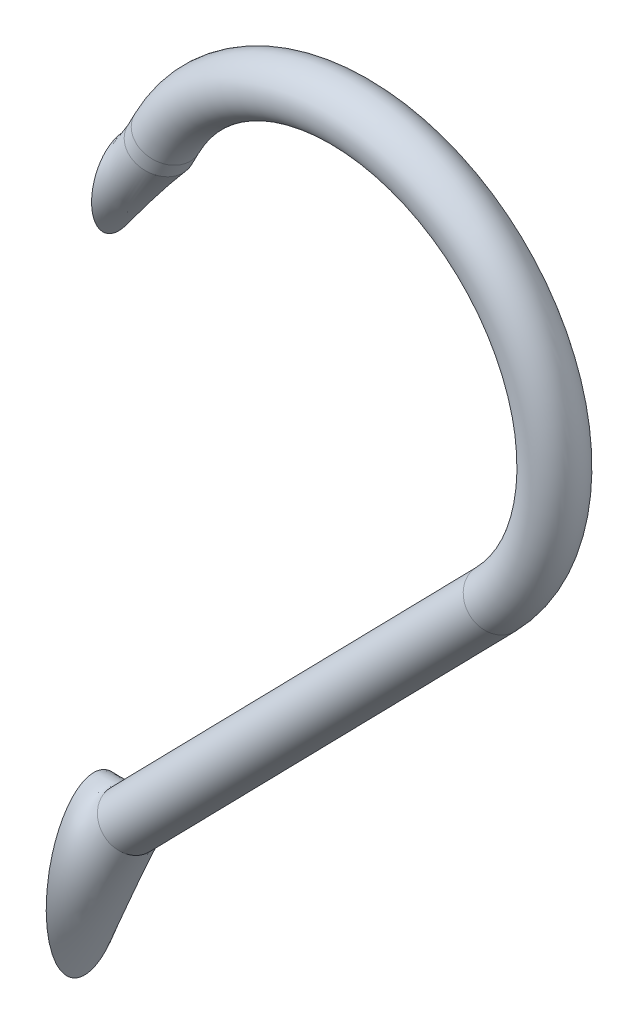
ISO-10303-21;
HEADER;
FILE_DESCRIPTION(('STEP AP214'),'2;1');
FILE_NAME('part.step','',(''),(''),'','','');
FILE_SCHEMA(('AUTOMOTIVE_DESIGN { 1 0 10303 214 1 1 1 1 }'));
ENDSEC;
DATA;
#1=APPLICATION_CONTEXT('core data for automotive mechanical design processes');
#2=APPLICATION_PROTOCOL_DEFINITION('international standard','automotive_design',2000,#1);
#3=PRODUCT_CONTEXT('',#1,'mechanical');
#4=PRODUCT('Part','Part','',(#3));
#5=PRODUCT_RELATED_PRODUCT_CATEGORY('part','',(#4));
#6=PRODUCT_DEFINITION_FORMATION('','',#4);
#7=PRODUCT_DEFINITION_CONTEXT('part definition',#1,'design');
#8=PRODUCT_DEFINITION('design','',#6,#7);
#9=PRODUCT_DEFINITION_SHAPE('','',#8);
#10=(LENGTH_UNIT() NAMED_UNIT(*) SI_UNIT(.MILLI.,.METRE.));
#11=(NAMED_UNIT(*) PLANE_ANGLE_UNIT() SI_UNIT($,.RADIAN.));
#12=(NAMED_UNIT(*) SI_UNIT($,.STERADIAN.) SOLID_ANGLE_UNIT());
#13=UNCERTAINTY_MEASURE_WITH_UNIT(LENGTH_MEASURE(1.E-05),#10,'distance_accuracy_value','');
#14=(GEOMETRIC_REPRESENTATION_CONTEXT(3) GLOBAL_UNCERTAINTY_ASSIGNED_CONTEXT((#13)) GLOBAL_UNIT_ASSIGNED_CONTEXT((#10,
#11,#12)) REPRESENTATION_CONTEXT('',''));
#15=CARTESIAN_POINT('',(0.,0.,0.));
#16=DIRECTION('',(0.,0.,1.));
#17=DIRECTION('',(1.,0.,0.));
#18=AXIS2_PLACEMENT_3D('',#15,#16,#17);
#19=CARTESIAN_POINT('',(31.3767815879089,43.2630513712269,0.));
#20=DIRECTION('',(0.462122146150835,0.886816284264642,0.));
#21=DIRECTION('',(-0.886816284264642,0.462122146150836,0.));
#22=AXIS2_PLACEMENT_3D('',#19,#20,#21);
#23=CYLINDRICAL_SURFACE('',#22,1.5);
#24=CARTESIAN_POINT('',(31.775093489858,44.0274152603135,0.));
#25=DIRECTION('',(-0.462122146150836,-0.886816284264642,0.));
#26=DIRECTION('',(0.886816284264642,-0.462122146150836,0.));
#27=AXIS2_PLACEMENT_3D('',#24,#25,#26);
#28=CIRCLE('',#27,1.5);
#29=CARTESIAN_POINT('',(30.4448690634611,44.7205984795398,0.));
#30=VERTEX_POINT('',#29);
#31=EDGE_CURVE('E65',#30,#30,#28,.T.);
#32=ORIENTED_EDGE('',*,*,#31,.T.);
#33=EDGE_LOOP('',(#32));
#34=FACE_BOUND('',#33,.T.);
#35=CARTESIAN_POINT('',(31.3767815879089,43.2630513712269,0.));
#36=DIRECTION('',(-0.462122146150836,-0.886816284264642,0.));
#37=DIRECTION('',(0.886816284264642,-0.462122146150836,0.));
#38=AXIS2_PLACEMENT_3D('',#35,#36,#37);
#39=CIRCLE('',#38,1.5);
#40=CARTESIAN_POINT('',(32.7070060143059,42.5698681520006,0.));
#41=VERTEX_POINT('',#40);
#42=EDGE_CURVE('E61',#41,#41,#39,.T.);
#43=ORIENTED_EDGE('',*,*,#42,.F.);
#44=EDGE_LOOP('',(#43));
#45=FACE_BOUND('',#44,.T.);
#46=ADVANCED_FACE('F57',(#34,#45),#23,.T.);
#47=CARTESIAN_POINT('',(42.0901426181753,38.6522177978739,0.));
#48=DIRECTION('',(0.,0.,-1.));
#49=DIRECTION('',(-1.,0.,0.));
#50=AXIS2_PLACEMENT_3D('',#47,#48,#49);
#51=TOROIDAL_SURFACE('',#50,11.6315513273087,1.5);
#52=CARTESIAN_POINT('',(50.4035236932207,30.5170668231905,0.));
#53=DIRECTION('',(0.69940378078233,0.714726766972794,0.));
#54=DIRECTION('',(-0.714726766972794,0.69940378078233,0.));
#55=AXIS2_PLACEMENT_3D('',#52,#53,#54);
#56=CIRCLE('',#55,1.5);
#57=CARTESIAN_POINT('',(51.4756138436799,29.467961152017,0.));
#58=VERTEX_POINT('',#57);
#59=EDGE_CURVE('E11',#58,#58,#56,.T.);
#60=CARTESIAN_POINT('',(42.0901426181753,38.6522177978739,0.));
#61=DIRECTION('',(0.,0.,-1.));
#62=DIRECTION('',(-1.,0.,0.));
#63=AXIS2_PLACEMENT_3D('',#60,#61,#62);
#64=CIRCLE('',#63,13.1315513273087);
#65=EDGE_CURVE('',#30,#58,#64,.T.);
#66=ORIENTED_EDGE('',*,*,#31,.F.);
#67=ORIENTED_EDGE('',*,*,#59,.T.);
#68=ORIENTED_EDGE('',*,*,#65,.T.);
#69=ORIENTED_EDGE('',*,*,#65,.F.);
#70=EDGE_LOOP('',(#66,#68,#67,#69));
#71=FACE_BOUND('',#70,.T.);
#72=ADVANCED_FACE('F146',(#71),#51,.T.);
#73=CARTESIAN_POINT('',(50.4035236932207,30.5170668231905,0.));
#74=DIRECTION('',(-0.699403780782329,-0.714726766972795,0.));
#75=DIRECTION('',(0.714726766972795,-0.699403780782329,0.));
#76=AXIS2_PLACEMENT_3D('',#73,#74,#75);
#77=CYLINDRICAL_SURFACE('',#76,1.5);
#78=CARTESIAN_POINT('',(29.7023887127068,9.36239811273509,0.));
#79=DIRECTION('',(0.69940378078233,0.714726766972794,0.));
#80=DIRECTION('',(-0.714726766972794,0.69940378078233,0.));
#81=AXIS2_PLACEMENT_3D('',#78,#79,#80);
#82=CIRCLE('',#81,1.5);
#83=CARTESIAN_POINT('',(28.6302985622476,10.4115037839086,0.));
#84=VERTEX_POINT('',#83);
#85=EDGE_CURVE('E71',#84,#84,#82,.T.);
#86=ORIENTED_EDGE('',*,*,#85,.T.);
#87=EDGE_LOOP('',(#86));
#88=FACE_BOUND('',#87,.T.);
#89=ORIENTED_EDGE('',*,*,#59,.F.);
#90=EDGE_LOOP('',(#89));
#91=FACE_BOUND('',#90,.T.);
#92=ADVANCED_FACE('F59',(#88,#91),#77,.T.);
#93=CARTESIAN_POINT('',(27.3910119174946,5.55956373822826,0.));
#94=DIRECTION('',(0.998664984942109,-0.0516550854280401,0.));
#95=DIRECTION('',(0.0516550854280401,0.998664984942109,0.));
#96=AXIS2_PLACEMENT_3D('',#93,#94,#95);
#97=PLANE('',#96);
#98=CARTESIAN_POINT('',(27.3910119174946,5.55956373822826,0.));
#99=DIRECTION('',(0.998664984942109,-0.0516550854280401,0.));
#100=DIRECTION('',(0.0516550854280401,0.998664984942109,0.));
#101=AXIS2_PLACEMENT_3D('',#98,#99,#100);
#102=ELLIPSE('',#101,5.10485482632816,2.41823915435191);
#103=CARTESIAN_POINT('',(27.6547036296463,10.6576035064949,0.));
#104=VERTEX_POINT('',#103);
#105=EDGE_CURVE('E74',#104,#104,#102,.T.);
#106=ORIENTED_EDGE('',*,*,#105,.F.);
#107=EDGE_LOOP('',(#106));
#108=FACE_BOUND('',#107,.T.);
#109=ADVANCED_FACE('F86',(#108),#97,.F.);
#110=CARTESIAN_POINT('',(27.128354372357,0.481517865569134,0.213961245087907));
#111=CARTESIAN_POINT('',(30.5928623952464,8.49101524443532,0.835313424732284));
#112=CARTESIAN_POINT('',(27.0816924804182,-0.420612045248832,-4.60354898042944));
#113=CARTESIAN_POINT('',(31.7869041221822,7.32257250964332,-1.65647427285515));
#114=CARTESIAN_POINT('',(27.6070075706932,9.73547970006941,-5.03147147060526));
#115=CARTESIAN_POINT('',(30.0059567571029,9.06533824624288,-3.32710112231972));
#116=CARTESIAN_POINT('',(27.6536694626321,10.6376096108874,-0.213961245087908));
#117=CARTESIAN_POINT('',(28.8119150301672,10.2337809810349,-0.835313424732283));
#118=CARTESIAN_POINT('',(27.700331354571,11.5397395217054,4.60354898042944));
#119=CARTESIAN_POINT('',(27.6178733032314,11.4022237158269,1.65647427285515));
#120=CARTESIAN_POINT('',(27.1750162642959,1.38364777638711,5.03147147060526));
#121=CARTESIAN_POINT('',(29.3988206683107,9.65945797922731,3.32710112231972));
#122=CARTESIAN_POINT('',(27.128354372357,0.481517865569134,0.213961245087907));
#123=CARTESIAN_POINT('',(30.5928623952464,8.49101524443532,0.835313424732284));
#124=(BOUNDED_SURFACE() B_SPLINE_SURFACE(3,1,((#110,#111),(#112,#113),(#114,#115),(#116,#117),
(#118,#119),(#120,#121),(#122,#123)),.UNSPECIFIED.,.T.,.F.,.F.) B_SPLINE_SURFACE_WITH_KNOTS((4,
3,4),(2,2),(0.,0.5,1.),(0.,1.),
.UNSPECIFIED.) GEOMETRIC_REPRESENTATION_ITEM() RATIONAL_B_SPLINE_SURFACE(((1.,1.),
(0.333333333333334,0.333333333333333),(0.333333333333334,0.333333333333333),(1.,1.),
(0.333333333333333,0.333333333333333),(0.333333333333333,0.333333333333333),(1.,1.))) REPRESENTATION_ITEM('') SURFACE());
#125=ORIENTED_EDGE('',*,*,#105,.T.);
#126=EDGE_LOOP('',(#125));
#127=FACE_BOUND('',#126,.T.);
#128=ORIENTED_EDGE('',*,*,#85,.F.);
#129=EDGE_LOOP('',(#128));
#130=FACE_BOUND('',#129,.T.);
#131=ADVANCED_FACE('F96',(#127,#130),#124,.T.);
#132=CARTESIAN_POINT('',(29.1927330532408,40.3928390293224,0.));
#133=DIRECTION('',(0.998664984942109,-0.0516550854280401,0.));
#134=DIRECTION('',(0.0516550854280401,0.998664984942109,0.));
#135=AXIS2_PLACEMENT_3D('',#132,#133,#134);
#136=PLANE('',#135);
#137=CARTESIAN_POINT('',(29.1927330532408,40.3928390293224,0.));
#138=DIRECTION('',(0.998664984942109,-0.0516550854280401,0.));
#139=DIRECTION('',(0.0516550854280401,0.998664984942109,0.));
#140=AXIS2_PLACEMENT_3D('',#137,#138,#139);
#141=ELLIPSE('',#140,2.48810244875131,1.65965828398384);
#142=CARTESIAN_POINT('',(29.3212561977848,42.877619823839,0.));
#143=VERTEX_POINT('',#142);
#144=EDGE_CURVE('E79',#143,#143,#141,.T.);
#145=ORIENTED_EDGE('',*,*,#144,.F.);
#146=EDGE_LOOP('',(#145));
#147=FACE_BOUND('',#146,.T.);
#148=ADVANCED_FACE('F108',(#147),#136,.F.);
#149=CARTESIAN_POINT('',(29.3212561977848,42.877619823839,0.));
#150=CARTESIAN_POINT('',(30.2478368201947,43.851347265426,-0.793342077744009));
#151=CARTESIAN_POINT('',(29.3212561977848,42.877619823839,3.31931656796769));
#152=CARTESIAN_POINT('',(28.8407394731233,44.5845891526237,1.75272025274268));
#153=CARTESIAN_POINT('',(29.0642099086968,37.9080582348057,3.31931656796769));
#154=CARTESIAN_POINT('',(31.0986290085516,43.4079973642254,3.33940440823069));
#155=CARTESIAN_POINT('',(29.0642099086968,37.9080582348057,0.));
#156=CARTESIAN_POINT('',(32.5057263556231,42.6747554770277,0.793342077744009));
#157=CARTESIAN_POINT('',(29.0642099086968,37.9080582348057,-3.31931656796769));
#158=CARTESIAN_POINT('',(33.9128237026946,41.9415135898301,-1.75272025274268));
#159=CARTESIAN_POINT('',(29.3212561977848,42.877619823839,-3.31931656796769));
#160=CARTESIAN_POINT('',(31.6549341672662,43.1181053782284,-3.33940440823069));
#161=CARTESIAN_POINT('',(29.3212561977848,42.877619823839,0.));
#162=CARTESIAN_POINT('',(30.2478368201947,43.851347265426,-0.793342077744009));
#163=(BOUNDED_SURFACE() B_SPLINE_SURFACE(3,1,((#149,#150),(#151,#152),(#153,#154),(#155,#156),
(#157,#158),(#159,#160),(#161,#162)),.UNSPECIFIED.,.T.,.F.,.F.) B_SPLINE_SURFACE_WITH_KNOTS((4,
3,4),(2,2),(0.,0.5,1.),(0.,1.),
.UNSPECIFIED.) GEOMETRIC_REPRESENTATION_ITEM() RATIONAL_B_SPLINE_SURFACE(((1.,1.),
(0.333333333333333,0.333333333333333),(0.333333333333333,0.333333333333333),(1.,1.),
(0.333333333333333,0.333333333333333),(0.333333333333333,0.333333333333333),(1.,1.))) REPRESENTATION_ITEM('') SURFACE());
#164=ORIENTED_EDGE('',*,*,#144,.T.);
#165=EDGE_LOOP('',(#164));
#166=FACE_BOUND('',#165,.T.);
#167=ORIENTED_EDGE('',*,*,#42,.T.);
#168=EDGE_LOOP('',(#167));
#169=FACE_BOUND('',#168,.T.);
#170=ADVANCED_FACE('F98',(#166,#169),#163,.T.);
#171=CLOSED_SHELL('',(#46,#72,#92,#109,#131,#148,#170));
#172=MANIFOLD_SOLID_BREP('B2',#171);
#173=ADVANCED_BREP_SHAPE_REPRESENTATION('',(#18,#172),#14);
#174=SHAPE_DEFINITION_REPRESENTATION(#9,#173);
ENDSEC;
END-ISO-10303-21;
